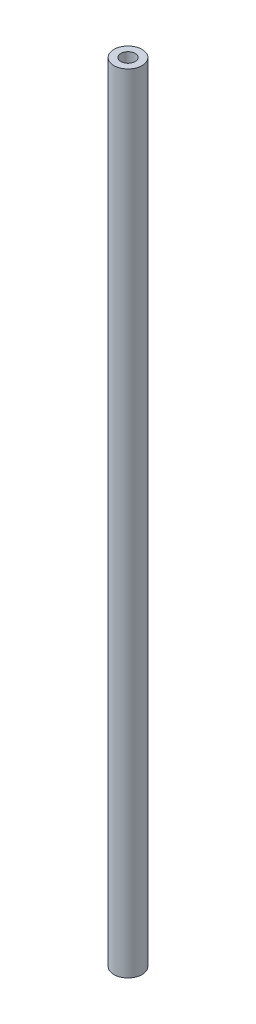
from build123d import *

# Parameters (mm, degrees)
SKETCH1_R                        = 4.7625
SKETCH1_R_2                      = 1.8415
BOSS_EXTRUDE1_DEPTH              = 266.7
F_10_32_TAPPED_HOLE1_D           = 4.0386
F_10_32_TAPPED_HOLE1_DEPTH       = 31.75
F_10_32_TAPPED_HOLE1_CBORE_D     = 4.826
F_10_32_TAPPED_HOLE1_CBORE_DEPTH = 25.4
F_10_32_TAPPED_HOLE1_TIP         = 1.213317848
F_10_32_TAPPED_HOLE2_D           = 4.0386
F_10_32_TAPPED_HOLE2_DEPTH       = 31.75
F_10_32_TAPPED_HOLE2_CBORE_D     = 4.826
F_10_32_TAPPED_HOLE2_CBORE_DEPTH = 25.4
F_10_32_TAPPED_HOLE2_TIP         = 1.213317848


with BuildPart() as part:
    # Sketch1 → Boss-Extrude1 (new body)
    with BuildSketch(Plane(origin=(0, 0, 0), x_dir=(1, 0, 0), z_dir=(0, 1, 0))):
        with Locations(Location((0, 0, 0), (0, 0, 270))):
            Circle(SKETCH1_R)
        with Locations(Location((0, 0, 0), (0, 0, 270))):
            Circle(SKETCH1_R_2, mode=Mode.SUBTRACT)
    extrude(amount=BOSS_EXTRUDE1_DEPTH)

    # 10-32 Tapped Hole1
    with Locations(Plane(origin=(0, 0, 0), x_dir=(-1, 0, 0), z_dir=(0, -1, 0))):
        with Locations((0, 0)):
            CounterBoreHole(F_10_32_TAPPED_HOLE1_D / 2, F_10_32_TAPPED_HOLE1_CBORE_D / 2, F_10_32_TAPPED_HOLE1_CBORE_DEPTH, depth=F_10_32_TAPPED_HOLE1_DEPTH)
            with Locations((0, 0, -(F_10_32_TAPPED_HOLE1_DEPTH + F_10_32_TAPPED_HOLE1_TIP / 2))):  # 118° drill point
                Cone(0, F_10_32_TAPPED_HOLE1_D / 2, F_10_32_TAPPED_HOLE1_TIP, mode=Mode.SUBTRACT)

    # 10-32 Tapped Hole2
    with Locations(Plane(origin=(0, 266.7, 0), x_dir=(1, 0, 0), z_dir=(0, 1, 0))):
        with Locations((0, 0)):
            CounterBoreHole(F_10_32_TAPPED_HOLE2_D / 2, F_10_32_TAPPED_HOLE2_CBORE_D / 2, F_10_32_TAPPED_HOLE2_CBORE_DEPTH, depth=F_10_32_TAPPED_HOLE2_DEPTH)
            with Locations((0, 0, -(F_10_32_TAPPED_HOLE2_DEPTH + F_10_32_TAPPED_HOLE2_TIP / 2))):  # 118° drill point
                Cone(0, F_10_32_TAPPED_HOLE2_D / 2, F_10_32_TAPPED_HOLE2_TIP, mode=Mode.SUBTRACT)


solid = part.part
